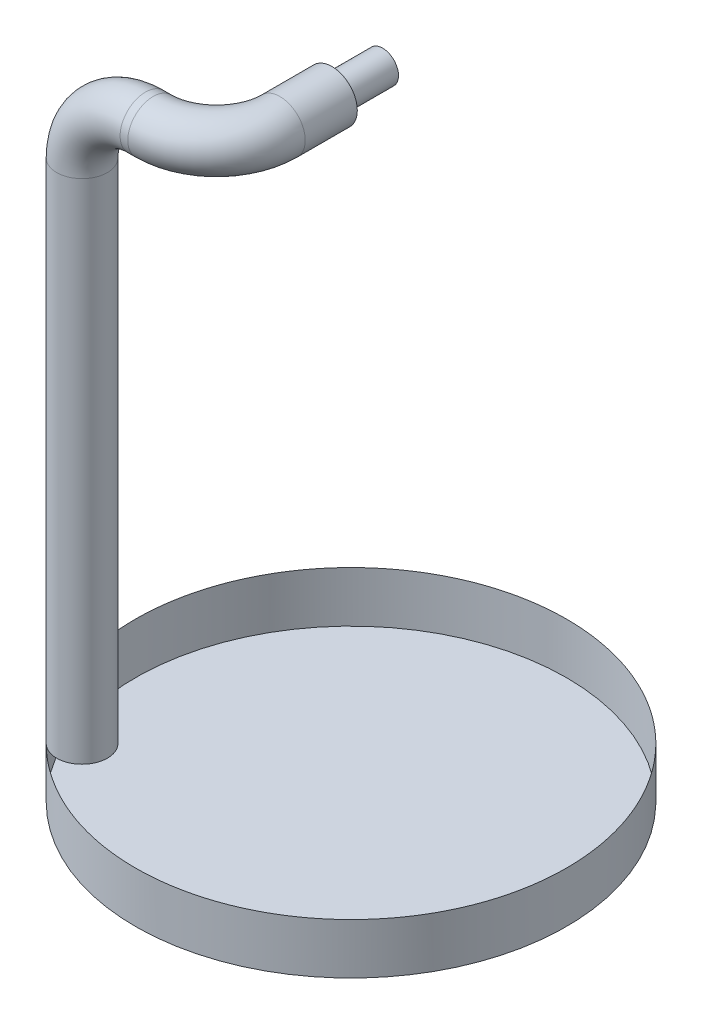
ISO-10303-21;
HEADER;
FILE_DESCRIPTION(('STEP AP214'),'2;1');
FILE_NAME('part.step','',(''),(''),'','','');
FILE_SCHEMA(('AUTOMOTIVE_DESIGN { 1 0 10303 214 1 1 1 1 }'));
ENDSEC;
DATA;
#1=APPLICATION_CONTEXT('core data for automotive mechanical design processes');
#2=APPLICATION_PROTOCOL_DEFINITION('international standard','automotive_design',2000,#1);
#3=PRODUCT_CONTEXT('',#1,'mechanical');
#4=PRODUCT('Part','Part','',(#3));
#5=PRODUCT_RELATED_PRODUCT_CATEGORY('part','',(#4));
#6=PRODUCT_DEFINITION_FORMATION('','',#4);
#7=PRODUCT_DEFINITION_CONTEXT('part definition',#1,'design');
#8=PRODUCT_DEFINITION('design','',#6,#7);
#9=PRODUCT_DEFINITION_SHAPE('','',#8);
#10=(LENGTH_UNIT() NAMED_UNIT(*) SI_UNIT(.MILLI.,.METRE.));
#11=(NAMED_UNIT(*) PLANE_ANGLE_UNIT() SI_UNIT($,.RADIAN.));
#12=(NAMED_UNIT(*) SI_UNIT($,.STERADIAN.) SOLID_ANGLE_UNIT());
#13=UNCERTAINTY_MEASURE_WITH_UNIT(LENGTH_MEASURE(1.E-05),#10,'distance_accuracy_value','');
#14=(GEOMETRIC_REPRESENTATION_CONTEXT(3) GLOBAL_UNCERTAINTY_ASSIGNED_CONTEXT((#13)) GLOBAL_UNIT_ASSIGNED_CONTEXT((#10,
#11,#12)) REPRESENTATION_CONTEXT('',''));
#15=CARTESIAN_POINT('',(0.,0.,0.));
#16=DIRECTION('',(0.,0.,1.));
#17=DIRECTION('',(1.,0.,0.));
#18=AXIS2_PLACEMENT_3D('',#15,#16,#17);
#19=CARTESIAN_POINT('',(21.2099999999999,90.,-18.21));
#20=DIRECTION('',(0.,0.,-1.));
#21=DIRECTION('',(1.,0.,0.));
#22=AXIS2_PLACEMENT_3D('',#19,#20,#21);
#23=PLANE('',#22);
#24=CARTESIAN_POINT('',(21.2099999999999,90.,-18.21));
#25=DIRECTION('',(0.,0.,-1.));
#26=DIRECTION('',(1.,0.,0.));
#27=AXIS2_PLACEMENT_3D('',#24,#25,#26);
#28=CIRCLE('',#27,4.);
#29=CARTESIAN_POINT('',(25.2099999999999,90.,-18.21));
#30=VERTEX_POINT('',#29);
#31=EDGE_CURVE('E11',#30,#30,#28,.T.);
#32=ORIENTED_EDGE('',*,*,#31,.T.);
#33=EDGE_LOOP('',(#32));
#34=FACE_BOUND('',#33,.T.);
#35=CARTESIAN_POINT('',(21.2099999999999,90.,-18.21));
#36=DIRECTION('',(0.,0.,-1.));
#37=DIRECTION('',(-1.,0.,0.));
#38=AXIS2_PLACEMENT_3D('',#35,#36,#37);
#39=CIRCLE('',#38,2.5);
#40=CARTESIAN_POINT('',(18.7099999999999,90.,-18.21));
#41=VERTEX_POINT('',#40);
#42=EDGE_CURVE('E46',#41,#41,#39,.T.);
#43=ORIENTED_EDGE('',*,*,#42,.F.);
#44=EDGE_LOOP('',(#43));
#45=FACE_BOUND('',#44,.T.);
#46=ADVANCED_FACE('F26',(#34,#45),#23,.T.);
#47=CARTESIAN_POINT('',(21.21,90.,-10.));
#48=DIRECTION('',(0.,0.,-1.));
#49=DIRECTION('',(-1.,0.,0.));
#50=AXIS2_PLACEMENT_3D('',#47,#48,#49);
#51=CYLINDRICAL_SURFACE('',#50,4.);
#52=CARTESIAN_POINT('',(21.21,90.,-10.));
#53=DIRECTION('',(0.,0.,-1.));
#54=DIRECTION('',(1.,0.,0.));
#55=AXIS2_PLACEMENT_3D('',#52,#53,#54);
#56=CIRCLE('',#55,4.);
#57=CARTESIAN_POINT('',(25.21,90.,-10.0000000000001));
#58=VERTEX_POINT('',#57);
#59=EDGE_CURVE('E33',#58,#58,#56,.T.);
#60=ORIENTED_EDGE('',*,*,#59,.T.);
#61=EDGE_LOOP('',(#60));
#62=FACE_BOUND('',#61,.T.);
#63=ORIENTED_EDGE('',*,*,#31,.F.);
#64=EDGE_LOOP('',(#63));
#65=FACE_BOUND('',#64,.T.);
#66=ADVANCED_FACE('F28',(#62,#65),#51,.T.);
#67=CARTESIAN_POINT('',(11.21,90.,-10.));
#68=DIRECTION('',(0.,1.,0.));
#69=DIRECTION('',(0.,0.,1.));
#70=AXIS2_PLACEMENT_3D('',#67,#68,#69);
#71=TOROIDAL_SURFACE('',#70,10.,4.);
#72=CARTESIAN_POINT('',(11.21,90.,0.));
#73=DIRECTION('',(1.,0.,0.));
#74=DIRECTION('',(0.,0.,1.));
#75=AXIS2_PLACEMENT_3D('',#72,#73,#74);
#76=CIRCLE('',#75,4.);
#77=CARTESIAN_POINT('',(11.21,90.,4.));
#78=VERTEX_POINT('',#77);
#79=EDGE_CURVE('E61',#78,#78,#76,.T.);
#80=CARTESIAN_POINT('',(11.21,90.,-10.));
#81=DIRECTION('',(0.,1.,0.));
#82=DIRECTION('',(0.,0.,1.));
#83=AXIS2_PLACEMENT_3D('',#80,#81,#82);
#84=CIRCLE('',#83,14.);
#85=EDGE_CURVE('',#78,#58,#84,.T.);
#86=ORIENTED_EDGE('',*,*,#79,.T.);
#87=ORIENTED_EDGE('',*,*,#59,.F.);
#88=ORIENTED_EDGE('',*,*,#85,.T.);
#89=ORIENTED_EDGE('',*,*,#85,.F.);
#90=EDGE_LOOP('',(#86,#88,#87,#89));
#91=FACE_BOUND('',#90,.T.);
#92=ADVANCED_FACE('F68',(#91),#71,.T.);
#93=CARTESIAN_POINT('',(10.,90.,0.));
#94=DIRECTION('',(1.,0.,0.));
#95=DIRECTION('',(0.,0.,-1.));
#96=AXIS2_PLACEMENT_3D('',#93,#94,#95);
#97=CYLINDRICAL_SURFACE('',#96,4.);
#98=CARTESIAN_POINT('',(10.,90.,0.));
#99=DIRECTION('',(1.,0.,0.));
#100=DIRECTION('',(0.,0.,1.));
#101=AXIS2_PLACEMENT_3D('',#98,#99,#100);
#102=CIRCLE('',#101,4.);
#103=CARTESIAN_POINT('',(10.,94.,0.));
#104=VERTEX_POINT('',#103);
#105=EDGE_CURVE('E58',#104,#104,#102,.T.);
#106=ORIENTED_EDGE('',*,*,#105,.T.);
#107=EDGE_LOOP('',(#106));
#108=FACE_BOUND('',#107,.T.);
#109=ORIENTED_EDGE('',*,*,#79,.F.);
#110=EDGE_LOOP('',(#109));
#111=FACE_BOUND('',#110,.T.);
#112=ADVANCED_FACE('F70',(#108,#111),#97,.T.);
#113=CARTESIAN_POINT('',(10.,80.,0.));
#114=DIRECTION('',(0.,0.,-1.));
#115=DIRECTION('',(-1.,0.,0.));
#116=AXIS2_PLACEMENT_3D('',#113,#114,#115);
#117=TOROIDAL_SURFACE('',#116,10.,4.);
#118=CARTESIAN_POINT('',(0.,80.,0.));
#119=DIRECTION('',(0.,1.,0.));
#120=DIRECTION('',(0.,0.,1.));
#121=AXIS2_PLACEMENT_3D('',#118,#119,#120);
#122=CIRCLE('',#121,4.);
#123=CARTESIAN_POINT('',(-4.,80.,0.));
#124=VERTEX_POINT('',#123);
#125=EDGE_CURVE('E55',#124,#124,#122,.T.);
#126=CARTESIAN_POINT('',(10.,80.,0.));
#127=DIRECTION('',(0.,0.,-1.));
#128=DIRECTION('',(-1.,0.,0.));
#129=AXIS2_PLACEMENT_3D('',#126,#127,#128);
#130=CIRCLE('',#129,14.);
#131=EDGE_CURVE('',#124,#104,#130,.T.);
#132=ORIENTED_EDGE('',*,*,#125,.T.);
#133=ORIENTED_EDGE('',*,*,#105,.F.);
#134=ORIENTED_EDGE('',*,*,#131,.T.);
#135=ORIENTED_EDGE('',*,*,#131,.F.);
#136=EDGE_LOOP('',(#132,#134,#133,#135));
#137=FACE_BOUND('',#136,.T.);
#138=ADVANCED_FACE('F76',(#137),#117,.T.);
#139=CARTESIAN_POINT('',(0.,80.,0.));
#140=DIRECTION('',(0.,-1.,0.));
#141=DIRECTION('',(0.,0.,-1.));
#142=AXIS2_PLACEMENT_3D('',#139,#140,#141);
#143=CYLINDRICAL_SURFACE('',#142,4.);
#144=ORIENTED_EDGE('',*,*,#125,.F.);
#145=EDGE_LOOP('',(#144));
#146=FACE_BOUND('',#145,.T.);
#147=CARTESIAN_POINT('',(0.,0.,0.));
#148=DIRECTION('',(0.,1.,0.));
#149=DIRECTION('',(0.,0.,1.));
#150=AXIS2_PLACEMENT_3D('',#147,#148,#149);
#151=CIRCLE('',#150,4.);
#152=CARTESIAN_POINT('',(-2.8284271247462,0.,2.82842712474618));
#153=VERTEX_POINT('',#152);
#154=EDGE_CURVE('E41',#153,#153,#151,.T.);
#155=ORIENTED_EDGE('',*,*,#154,.T.);
#156=EDGE_LOOP('',(#155));
#157=FACE_BOUND('',#156,.T.);
#158=ADVANCED_FACE('F91',(#146,#157),#143,.T.);
#159=CARTESIAN_POINT('',(21.2099999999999,90.,-26.21));
#160=DIRECTION('',(0.,0.,1.));
#161=DIRECTION('',(1.,0.,0.));
#162=AXIS2_PLACEMENT_3D('',#159,#160,#161);
#163=CYLINDRICAL_SURFACE('',#162,2.5);
#164=CARTESIAN_POINT('',(21.2099999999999,90.,-26.21));
#165=DIRECTION('',(0.,0.,-1.));
#166=DIRECTION('',(-1.,0.,0.));
#167=AXIS2_PLACEMENT_3D('',#164,#165,#166);
#168=CIRCLE('',#167,2.5);
#169=CARTESIAN_POINT('',(18.7099999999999,90.,-26.21));
#170=VERTEX_POINT('',#169);
#171=EDGE_CURVE('E51',#170,#170,#168,.T.);
#172=ORIENTED_EDGE('',*,*,#171,.F.);
#173=EDGE_LOOP('',(#172));
#174=FACE_BOUND('',#173,.T.);
#175=ORIENTED_EDGE('',*,*,#42,.T.);
#176=EDGE_LOOP('',(#175));
#177=FACE_BOUND('',#176,.T.);
#178=ADVANCED_FACE('F89',(#174,#177),#163,.T.);
#179=CARTESIAN_POINT('',(21.2099999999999,90.,-26.21));
#180=DIRECTION('',(0.,0.,-1.));
#181=DIRECTION('',(-1.,0.,0.));
#182=AXIS2_PLACEMENT_3D('',#179,#180,#181);
#183=PLANE('',#182);
#184=ORIENTED_EDGE('',*,*,#171,.T.);
#185=EDGE_LOOP('',(#184));
#186=FACE_BOUND('',#185,.T.);
#187=ADVANCED_FACE('F128',(#186),#183,.T.);
#188=CARTESIAN_POINT('',(21.2132034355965,-8.,-21.2132034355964));
#189=DIRECTION('',(0.,1.,0.));
#190=DIRECTION('',(0.,0.,1.));
#191=AXIS2_PLACEMENT_3D('',#188,#189,#190);
#192=CYLINDRICAL_SURFACE('',#191,34.);
#193=CARTESIAN_POINT('',(21.2132034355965,-8.,-21.2132034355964));
#194=DIRECTION('',(0.,-1.,0.));
#195=DIRECTION('',(0.,0.,-1.));
#196=AXIS2_PLACEMENT_3D('',#193,#194,#195);
#197=CIRCLE('',#196,34.);
#198=CARTESIAN_POINT('',(21.2132034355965,-8.,-55.2132034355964));
#199=VERTEX_POINT('',#198);
#200=EDGE_CURVE('E43',#199,#199,#197,.T.);
#201=ORIENTED_EDGE('',*,*,#200,.F.);
#202=EDGE_LOOP('',(#201));
#203=FACE_BOUND('',#202,.T.);
#204=CARTESIAN_POINT('',(21.2132034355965,0.,-21.2132034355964));
#205=DIRECTION('',(0.,-1.,0.));
#206=DIRECTION('',(0.,0.,-1.));
#207=AXIS2_PLACEMENT_3D('',#204,#205,#206);
#208=CIRCLE('',#207,34.);
#209=EDGE_CURVE('E38',#153,#153,#208,.T.);
#210=ORIENTED_EDGE('',*,*,#209,.T.);
#211=EDGE_LOOP('',(#210));
#212=FACE_BOUND('',#211,.T.);
#213=ADVANCED_FACE('F134',(#203,#212),#192,.T.);
#214=CARTESIAN_POINT('',(21.2132034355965,-8.,-21.2132034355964));
#215=DIRECTION('',(0.,-1.,0.));
#216=DIRECTION('',(0.,0.,-1.));
#217=AXIS2_PLACEMENT_3D('',#214,#215,#216);
#218=PLANE('',#217);
#219=ORIENTED_EDGE('',*,*,#200,.T.);
#220=EDGE_LOOP('',(#219));
#221=FACE_BOUND('',#220,.T.);
#222=ADVANCED_FACE('F140',(#221),#218,.T.);
#223=CARTESIAN_POINT('',(21.2132034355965,0.,-21.2132034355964));
#224=DIRECTION('',(0.,-1.,0.));
#225=DIRECTION('',(0.,0.,-1.));
#226=AXIS2_PLACEMENT_3D('',#223,#224,#225);
#227=PLANE('',#226);
#228=ORIENTED_EDGE('',*,*,#209,.F.);
#229=ORIENTED_EDGE('',*,*,#154,.F.);
#230=EDGE_LOOP('',(#228,#229));
#231=FACE_BOUND('',#230,.T.);
#232=ADVANCED_FACE('F39',(#231),#227,.F.);
#233=CLOSED_SHELL('',(#46,#66,#92,#112,#138,#158,#178,#187,#213,#222,#232));
#234=MANIFOLD_SOLID_BREP('B2',#233);
#235=ADVANCED_BREP_SHAPE_REPRESENTATION('',(#18,#234),#14);
#236=SHAPE_DEFINITION_REPRESENTATION(#9,#235);
ENDSEC;
END-ISO-10303-21;
